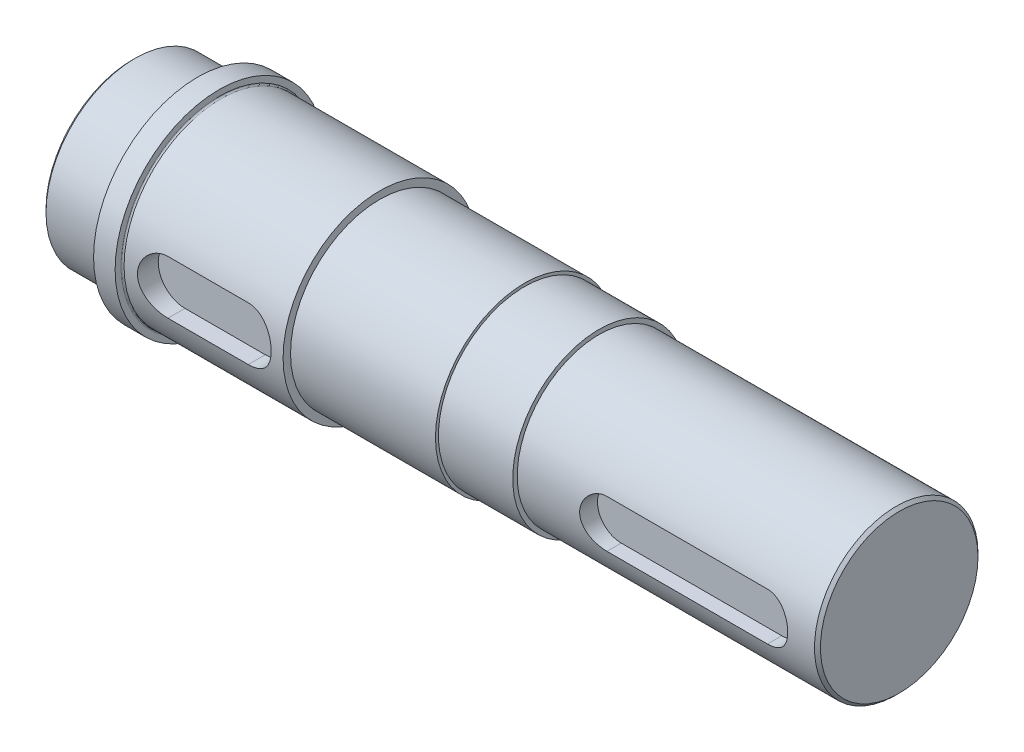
from build123d import *

# Parameters (mm, degrees)
CHAMFER1_SIZE      = 1
CUT_EXTRUDE1_DEPTH = 6
CUT_EXTRUDE2_DEPTH = 7
FILLET1_R          = 0.5


with BuildPart() as part:
    # Sketch1 → Revolve1 (revolve)
    with BuildSketch(Plane.XY, mode=Mode.PRIVATE) as revolve1_sk:
        Polygon((0, 0), (0, 30), (22, 30), (22, 35), (29.25, 35), (29.25, 32.5), (83.25, 32.5), (83.25, 30), (132, 30), (132, 29), (157, 29), (157, 27.5), (258, 27.5), (258, 0), align=None)
    revolve(revolve1_sk.sketch.rotate(Axis((277.093607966, 0, 0), (-1, 0, 0)), 90), axis=Axis((277.093607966, 0, 0), (-1, 0, 0)))

    # Chamfer1
    chamfer1_edges = [part.edges().sort_by_distance(p)[0] for p in [
        (0, 0, 30),
        (258, 0, 27.5),
    ]]
    chamfer(chamfer1_edges, length=CHAMFER1_SIZE)

    # Sketch2 → Cut-Extrude1 (cut)
    with BuildSketch(Plane.XY.offset(27.5)):
        with BuildLine():
            Line((240, 8), (186, 8))
            ThreePointArc((186, 8), (178, 0), (186, -8))
            Line((186, -8), (240, -8))
            ThreePointArc((240, -8), (248, 0), (240, 8))
        make_face()
    extrude(amount=-CUT_EXTRUDE1_DEPTH, mode=Mode.SUBTRACT)

    # Sketch3 → Cut-Extrude2 (cut)
    with BuildSketch(Plane.XY.offset(32.5)):
        with BuildLine():
            Line((70.25, 9), (43.25, 9))
            ThreePointArc((43.25, 9), (34.25, 0), (43.25, -9))
            Line((43.25, -9), (70.25, -9))
            ThreePointArc((70.25, -9), (79.25, 0), (70.25, 9))
        make_face()
    extrude(amount=-CUT_EXTRUDE2_DEPTH, mode=Mode.SUBTRACT)

    # Sketch4 → Cut-Revolve1 (revolve, cut)
    with BuildSketch(Plane.XY, mode=Mode.PRIVATE) as cut_revolve1_sk:
        Polygon((22, 30), (22, 29), (20, 29), (19, 30), align=None)
    revolve(cut_revolve1_sk.sketch.rotate(Axis((304.717159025, 0, 0), (-1, 0, 0)), 90), axis=Axis((304.717159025, 0, 0), (-1, 0, 0)), mode=Mode.SUBTRACT)

    # Fillet1
    fillet1_edges = [part.edges().sort_by_distance(p)[0] for p in [
        (29.25, 0, 32.5),
    ]]
    fillet(fillet1_edges, radius=FILLET1_R)


solid = part.part
